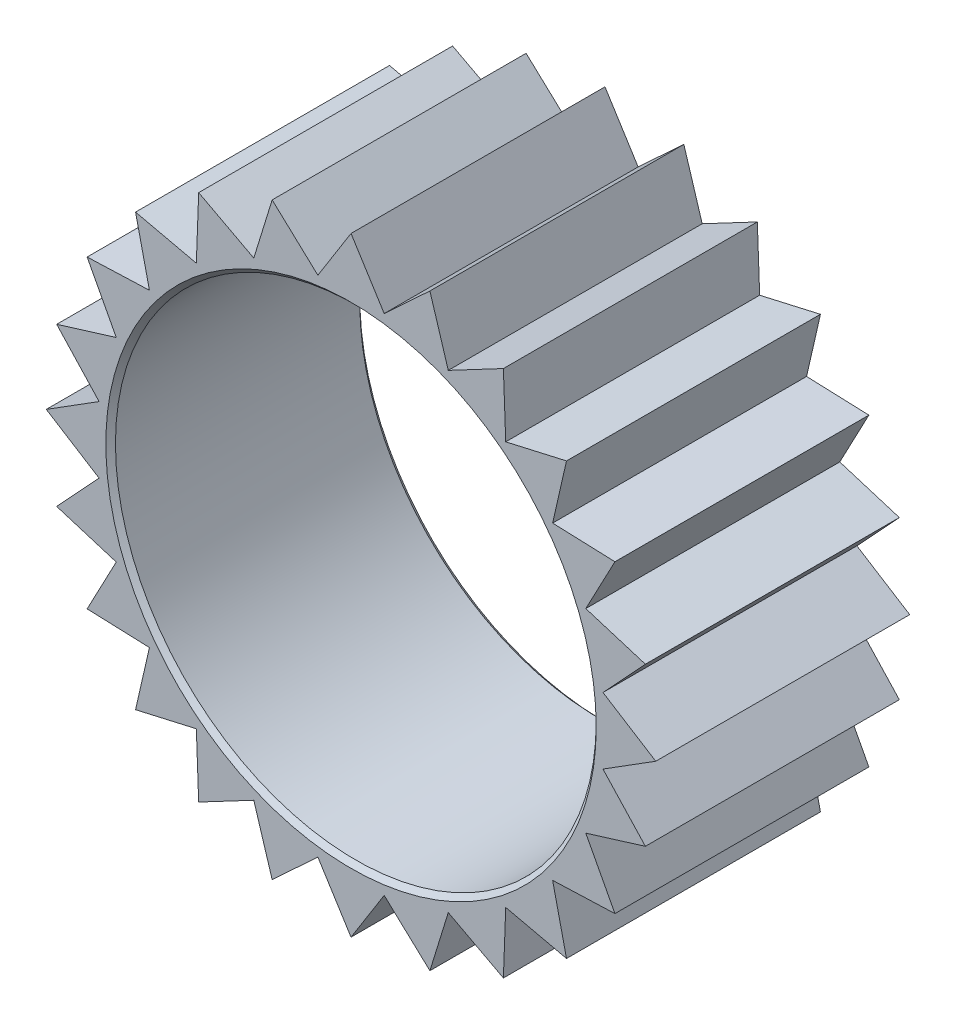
from build123d import *

# Parameters (mm, degrees)
SKETCH_DIAMETER_R           = 9.53135
SKETCH_DIAMETER_R_2         = 9.017
BOSS_EXTRUDE_DIAMETER_DEPTH = 9.525
BOSS_EXTRUDE_TOOTH_DEPTH    = 9.525
CIRPATTERN_TEETH_COUNT      = 24
CHAMFER_INNER_CIRCLE_SIZE   = 0.18034


with BuildPart() as part:
    # Sketch Diameter → Boss-Extrude Diameter (new body)
    with BuildSketch(Plane.XY):
        Circle(SKETCH_DIAMETER_R)
        Circle(SKETCH_DIAMETER_R_2, mode=Mode.SUBTRACT)
    extrude(amount=-BOSS_EXTRUDE_DIAMETER_DEPTH)

    # Sketch Tooth → Boss-Extrude Tooth (add)
    with BuildSketch(Plane.XY):
        with BuildLine():
            Line((-1.244090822, 9.449807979), (0, 11.43))
            Line((0, 11.43), (1.244090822, 9.449807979))
            ThreePointArc((1.244090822, 9.449807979), (0, 9.53135), (-1.244090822, 9.449807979))
        make_face()
    boss_extrude_tooth = extrude(amount=-BOSS_EXTRUDE_TOOTH_DEPTH)

    # CirPattern Teeth: Boss-Extrude Tooth ×24 about axis
    cirpattern_teeth_axis = Axis((0, 0, 0), (0, 0, 1))
    for i in range(1, CIRPATTERN_TEETH_COUNT):
        add(boss_extrude_tooth.rotate(cirpattern_teeth_axis, i * 360 / CIRPATTERN_TEETH_COUNT))

    # Chamfer Inner Circle
    chamfer_inner_circle_edges = [part.edges().sort_by_distance(p)[0] for p in [
        (-9.017, 0, -9.525),
        (-9.017, 0, 0),
    ]]
    chamfer(chamfer_inner_circle_edges, length=CHAMFER_INNER_CIRCLE_SIZE)


solid = part.part
